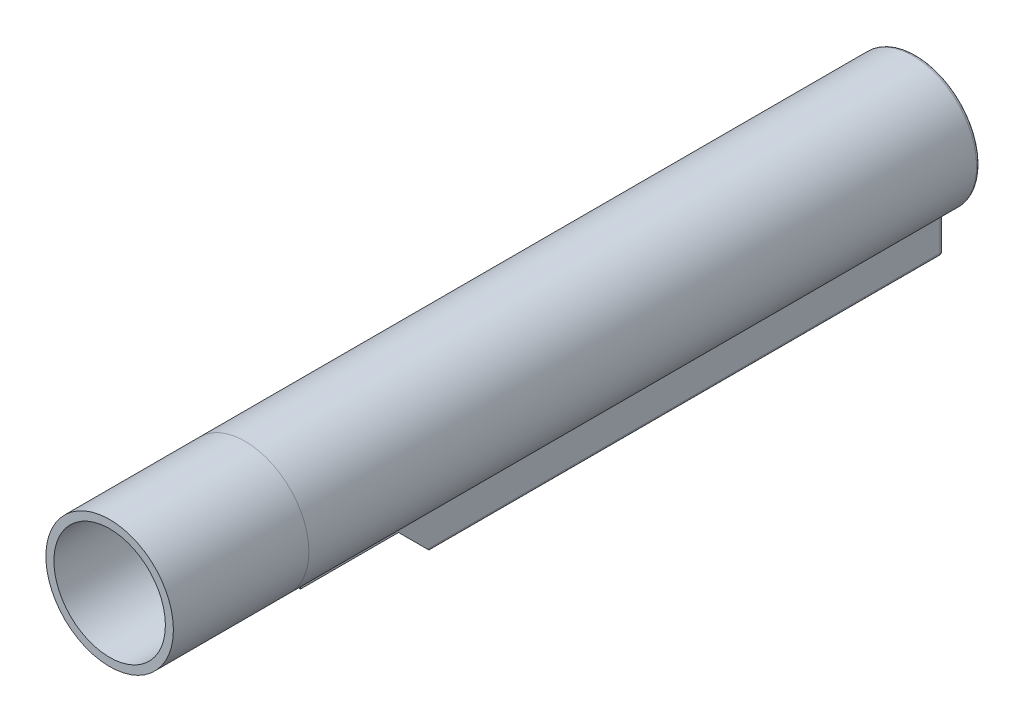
ISO-10303-21;
HEADER;
FILE_DESCRIPTION(('STEP AP214'),'2;1');
FILE_NAME('part.step','',(''),(''),'','','');
FILE_SCHEMA(('AUTOMOTIVE_DESIGN { 1 0 10303 214 1 1 1 1 }'));
ENDSEC;
DATA;
#1=APPLICATION_CONTEXT('core data for automotive mechanical design processes');
#2=APPLICATION_PROTOCOL_DEFINITION('international standard','automotive_design',2000,#1);
#3=PRODUCT_CONTEXT('',#1,'mechanical');
#4=PRODUCT('Part','Part','',(#3));
#5=PRODUCT_RELATED_PRODUCT_CATEGORY('part','',(#4));
#6=PRODUCT_DEFINITION_FORMATION('','',#4);
#7=PRODUCT_DEFINITION_CONTEXT('part definition',#1,'design');
#8=PRODUCT_DEFINITION('design','',#6,#7);
#9=PRODUCT_DEFINITION_SHAPE('','',#8);
#10=(LENGTH_UNIT() NAMED_UNIT(*) SI_UNIT(.MILLI.,.METRE.));
#11=(NAMED_UNIT(*) PLANE_ANGLE_UNIT() SI_UNIT($,.RADIAN.));
#12=(NAMED_UNIT(*) SI_UNIT($,.STERADIAN.) SOLID_ANGLE_UNIT());
#13=UNCERTAINTY_MEASURE_WITH_UNIT(LENGTH_MEASURE(1.E-05),#10,'distance_accuracy_value','');
#14=(GEOMETRIC_REPRESENTATION_CONTEXT(3) GLOBAL_UNCERTAINTY_ASSIGNED_CONTEXT((#13)) GLOBAL_UNIT_ASSIGNED_CONTEXT((#10,
#11,#12)) REPRESENTATION_CONTEXT('',''));
#15=CARTESIAN_POINT('',(0.,0.,0.));
#16=DIRECTION('',(0.,0.,1.));
#17=DIRECTION('',(1.,0.,0.));
#18=AXIS2_PLACEMENT_3D('',#15,#16,#17);
#19=CARTESIAN_POINT('',(0.,0.,146.5326));
#20=DIRECTION('',(0.,0.,-1.));
#21=DIRECTION('',(-1.,0.,0.));
#22=AXIS2_PLACEMENT_3D('',#19,#20,#21);
#23=CYLINDRICAL_SURFACE('',#22,14.5288);
#24=CARTESIAN_POINT('',(0.,0.,146.5326));
#25=DIRECTION('',(0.,0.,1.));
#26=DIRECTION('',(1.,0.,0.));
#27=AXIS2_PLACEMENT_3D('',#24,#25,#26);
#28=CIRCLE('',#27,14.5288);
#29=CARTESIAN_POINT('',(-6.66204510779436,-12.9113587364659,146.5326));
#30=VERTEX_POINT('',#29);
#31=CARTESIAN_POINT('',(6.66204510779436,-12.9113587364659,146.5326));
#32=VERTEX_POINT('',#31);
#33=EDGE_CURVE('E54',#30,#32,#28,.T.);
#34=ORIENTED_EDGE('',*,*,#33,.T.);
#35=DIRECTION('',(0.,0.,-1.));
#36=VECTOR('',#35,1.);
#37=CARTESIAN_POINT('',(6.66204510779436,-12.9113587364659,146.5326));
#38=LINE('',#37,#36);
#39=CARTESIAN_POINT('',(6.66204510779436,-12.9113587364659,0.787399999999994));
#40=VERTEX_POINT('',#39);
#41=EDGE_CURVE('E59',#32,#40,#38,.T.);
#42=ORIENTED_EDGE('',*,*,#41,.T.);
#43=CARTESIAN_POINT('',(0.,0.,0.787399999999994));
#44=DIRECTION('',(0.,0.,1.));
#45=DIRECTION('',(1.,0.,0.));
#46=AXIS2_PLACEMENT_3D('',#43,#44,#45);
#47=CIRCLE('',#46,14.5288);
#48=CARTESIAN_POINT('',(-6.66204510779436,-12.9113587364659,0.787399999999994));
#49=VERTEX_POINT('',#48);
#50=EDGE_CURVE('E328',#40,#49,#47,.T.);
#51=ORIENTED_EDGE('',*,*,#50,.T.);
#52=DIRECTION('',(0.,0.,-1.));
#53=VECTOR('',#52,1.);
#54=CARTESIAN_POINT('',(-6.66204510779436,-12.9113587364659,146.5326));
#55=LINE('',#54,#53);
#56=EDGE_CURVE('E326',#49,#30,#55,.F.);
#57=ORIENTED_EDGE('',*,*,#56,.T.);
#58=EDGE_LOOP('',(#34,#42,#51,#57));
#59=FACE_BOUND('',#58,.T.);
#60=CARTESIAN_POINT('',(0.,0.,152.9334));
#61=DIRECTION('',(0.,0.,1.));
#62=DIRECTION('',(1.,0.,0.));
#63=AXIS2_PLACEMENT_3D('',#60,#61,#62);
#64=CIRCLE('',#63,14.5288);
#65=CARTESIAN_POINT('',(14.5288,0.,152.9334));
#66=VERTEX_POINT('',#65);
#67=EDGE_CURVE('E12',#66,#66,#64,.T.);
#68=ORIENTED_EDGE('',*,*,#67,.F.);
#69=EDGE_LOOP('',(#68));
#70=FACE_BOUND('',#69,.T.);
#71=ADVANCED_FACE('F38',(#59,#70),#23,.T.);
#72=CARTESIAN_POINT('',(0.,-18.288,97.1677));
#73=DIRECTION('',(0.,-1.,0.));
#74=DIRECTION('',(0.,0.,-1.));
#75=AXIS2_PLACEMENT_3D('',#72,#73,#74);
#76=PLANE('',#75);
#77=CARTESIAN_POINT('',(0.,-18.288,36.1823));
#78=DIRECTION('',(0.,-1.,0.));
#79=DIRECTION('',(0.,0.,-1.));
#80=AXIS2_PLACEMENT_3D('',#77,#78,#79);
#81=CIRCLE('',#80,4.22910000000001);
#82=CARTESIAN_POINT('',(4.22910000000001,-18.288,36.1823));
#83=VERTEX_POINT('',#82);
#84=CARTESIAN_POINT('',(-4.22909999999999,-18.288,36.1823));
#85=VERTEX_POINT('',#84);
#86=EDGE_CURVE('E214',#83,#85,#81,.T.);
#87=ORIENTED_EDGE('',*,*,#86,.F.);
#88=DIRECTION('',(0.,0.,1.));
#89=VECTOR('',#88,1.);
#90=CARTESIAN_POINT('',(4.2291,-18.288,97.1677));
#91=LINE('',#90,#89);
#92=CARTESIAN_POINT('',(4.2291,-18.288,57.2643));
#93=VERTEX_POINT('',#92);
#94=EDGE_CURVE('E206',#83,#93,#91,.T.);
#95=ORIENTED_EDGE('',*,*,#94,.T.);
#96=CARTESIAN_POINT('',(0.,-18.288,57.2643));
#97=DIRECTION('',(0.,-1.,0.));
#98=DIRECTION('',(0.,0.,-1.));
#99=AXIS2_PLACEMENT_3D('',#96,#97,#98);
#100=CIRCLE('',#99,4.2291);
#101=CARTESIAN_POINT('',(-4.2291,-18.288,57.2643));
#102=VERTEX_POINT('',#101);
#103=EDGE_CURVE('E180',#102,#93,#100,.T.);
#104=ORIENTED_EDGE('',*,*,#103,.F.);
#105=DIRECTION('',(0.,0.,-1.));
#106=VECTOR('',#105,1.);
#107=CARTESIAN_POINT('',(-4.2291,-18.288,97.1677));
#108=LINE('',#107,#106);
#109=EDGE_CURVE('E412',#102,#85,#108,.T.);
#110=ORIENTED_EDGE('',*,*,#109,.T.);
#111=EDGE_LOOP('',(#87,#95,#104,#110));
#112=FACE_BOUND('',#111,.T.);
#113=ADVANCED_FACE('F213',(#112),#76,.T.);
#114=EDGE_CURVE('E184',#93,#102,#100,.T.);
#115=ORIENTED_EDGE('',*,*,#114,.F.);
#116=CARTESIAN_POINT('',(4.2291,-18.288,97.1677));
#117=VERTEX_POINT('',#116);
#118=EDGE_CURVE('E195',#93,#117,#91,.T.);
#119=ORIENTED_EDGE('',*,*,#118,.T.);
#120=CARTESIAN_POINT('',(0.,-18.288,97.1677));
#121=DIRECTION('',(0.,-1.,0.));
#122=DIRECTION('',(0.,0.,-1.));
#123=AXIS2_PLACEMENT_3D('',#120,#121,#122);
#124=CIRCLE('',#123,4.2291);
#125=CARTESIAN_POINT('',(-4.2291,-18.288,97.1677));
#126=VERTEX_POINT('',#125);
#127=EDGE_CURVE('E189',#126,#117,#124,.T.);
#128=ORIENTED_EDGE('',*,*,#127,.F.);
#129=EDGE_CURVE('E198',#126,#102,#108,.T.);
#130=ORIENTED_EDGE('',*,*,#129,.T.);
#131=EDGE_LOOP('',(#115,#119,#128,#130));
#132=FACE_BOUND('',#131,.T.);
#133=ADVANCED_FACE('F194',(#132),#76,.T.);
#134=CARTESIAN_POINT('',(-6.2357,-22.098,146.5326));
#135=DIRECTION('',(0.,1.,0.));
#136=DIRECTION('',(0.,0.,1.));
#137=AXIS2_PLACEMENT_3D('',#134,#135,#136);
#138=PLANE('',#137);
#139=DIRECTION('',(-1.,0.,0.));
#140=VECTOR('',#139,1.);
#141=CARTESIAN_POINT('',(-6.2357,-22.098,116.84));
#142=LINE('',#141,#140);
#143=CARTESIAN_POINT('',(5.4483,-22.098,116.84));
#144=VERTEX_POINT('',#143);
#145=CARTESIAN_POINT('',(-5.4483,-22.098,116.84));
#146=VERTEX_POINT('',#145);
#147=EDGE_CURVE('E263',#144,#146,#142,.T.);
#148=ORIENTED_EDGE('',*,*,#147,.T.);
#149=DIRECTION('',(0.,0.,-1.));
#150=VECTOR('',#149,1.);
#151=CARTESIAN_POINT('',(-5.4483,-22.098,146.5326));
#152=LINE('',#151,#150);
#153=CARTESIAN_POINT('',(-5.4483,-22.098,0.787399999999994));
#154=VERTEX_POINT('',#153);
#155=EDGE_CURVE('E316',#146,#154,#152,.T.);
#156=ORIENTED_EDGE('',*,*,#155,.T.);
#157=DIRECTION('',(1.,0.,0.));
#158=VECTOR('',#157,1.);
#159=CARTESIAN_POINT('',(-6.2357,-22.098,0.787399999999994));
#160=LINE('',#159,#158);
#161=CARTESIAN_POINT('',(5.4483,-22.098,0.787399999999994));
#162=VERTEX_POINT('',#161);
#163=EDGE_CURVE('E312',#154,#162,#160,.T.);
#164=ORIENTED_EDGE('',*,*,#163,.T.);
#165=DIRECTION('',(0.,0.,-1.));
#166=VECTOR('',#165,1.);
#167=CARTESIAN_POINT('',(5.4483,-22.098,146.5326));
#168=LINE('',#167,#166);
#169=EDGE_CURVE('E314',#162,#144,#168,.F.);
#170=ORIENTED_EDGE('',*,*,#169,.T.);
#171=EDGE_LOOP('',(#148,#156,#164,#170));
#172=FACE_BOUND('',#171,.T.);
#173=DIRECTION('',(0.,0.,1.));
#174=VECTOR('',#173,1.);
#175=CARTESIAN_POINT('',(5.01649999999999,-22.098,146.5326));
#176=LINE('',#175,#174);
#177=CARTESIAN_POINT('',(5.0165,-22.098,97.1677));
#178=VERTEX_POINT('',#177);
#179=CARTESIAN_POINT('',(5.01650000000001,-22.098,15.1003));
#180=VERTEX_POINT('',#179);
#181=EDGE_CURVE('E303',#178,#180,#176,.F.);
#182=ORIENTED_EDGE('',*,*,#181,.T.);
#183=CARTESIAN_POINT('',(0.,-22.098,15.1003));
#184=DIRECTION('',(0.,1.,0.));
#185=DIRECTION('',(0.,0.,1.));
#186=AXIS2_PLACEMENT_3D('',#183,#184,#185);
#187=CIRCLE('',#186,5.0165);
#188=CARTESIAN_POINT('',(-5.01649999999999,-22.098,15.1003));
#189=VERTEX_POINT('',#188);
#190=EDGE_CURVE('E309',#180,#189,#187,.T.);
#191=ORIENTED_EDGE('',*,*,#190,.T.);
#192=DIRECTION('',(0.,0.,-1.));
#193=VECTOR('',#192,1.);
#194=CARTESIAN_POINT('',(-5.01650000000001,-22.098,146.5326));
#195=LINE('',#194,#193);
#196=CARTESIAN_POINT('',(-5.0165,-22.098,97.1677));
#197=VERTEX_POINT('',#196);
#198=EDGE_CURVE('E307',#189,#197,#195,.F.);
#199=ORIENTED_EDGE('',*,*,#198,.T.);
#200=CARTESIAN_POINT('',(0.,-22.098,97.1677));
#201=DIRECTION('',(0.,1.,0.));
#202=DIRECTION('',(0.,0.,1.));
#203=AXIS2_PLACEMENT_3D('',#200,#201,#202);
#204=CIRCLE('',#203,5.0165);
#205=EDGE_CURVE('E305',#197,#178,#204,.T.);
#206=ORIENTED_EDGE('',*,*,#205,.T.);
#207=EDGE_LOOP('',(#182,#191,#199,#206));
#208=FACE_BOUND('',#207,.T.);
#209=ADVANCED_FACE('F391',(#172,#208),#138,.F.);
#210=CARTESIAN_POINT('',(0.,0.,146.5326));
#211=DIRECTION('',(0.,0.,-1.));
#212=DIRECTION('',(-1.,0.,0.));
#213=AXIS2_PLACEMENT_3D('',#210,#211,#212);
#214=CYLINDRICAL_SURFACE('',#213,1.1938);
#215=CARTESIAN_POINT('',(0.,0.,0.));
#216=DIRECTION('',(0.,0.,1.));
#217=DIRECTION('',(1.,0.,0.));
#218=AXIS2_PLACEMENT_3D('',#215,#216,#217);
#219=CIRCLE('',#218,1.1938);
#220=CARTESIAN_POINT('',(1.1938,0.,0.));
#221=VERTEX_POINT('',#220);
#222=EDGE_CURVE('E246',#221,#221,#219,.T.);
#223=ORIENTED_EDGE('',*,*,#222,.F.);
#224=EDGE_LOOP('',(#223));
#225=FACE_BOUND('',#224,.T.);
#226=CARTESIAN_POINT('',(0.,0.,1.82879999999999));
#227=DIRECTION('',(0.,0.,1.));
#228=DIRECTION('',(1.,0.,0.));
#229=AXIS2_PLACEMENT_3D('',#226,#227,#228);
#230=CIRCLE('',#229,1.1938);
#231=CARTESIAN_POINT('',(1.1938,0.,1.82879999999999));
#232=VERTEX_POINT('',#231);
#233=EDGE_CURVE('E242',#232,#232,#230,.T.);
#234=ORIENTED_EDGE('',*,*,#233,.T.);
#235=EDGE_LOOP('',(#234));
#236=FACE_BOUND('',#235,.T.);
#237=ADVANCED_FACE('F485',(#225,#236),#214,.F.);
#238=CARTESIAN_POINT('',(0.,0.,146.5326));
#239=DIRECTION('',(0.,0.,1.));
#240=DIRECTION('',(1.,0.,0.));
#241=AXIS2_PLACEMENT_3D('',#238,#239,#240);
#242=PLANE('',#241);
#243=DIRECTION('',(-1.,0.,0.));
#244=VECTOR('',#243,1.);
#245=CARTESIAN_POINT('',(10.6395598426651,-14.732,146.5326));
#246=LINE('',#245,#244);
#247=CARTESIAN_POINT('',(6.2357,-14.732,146.5326));
#248=VERTEX_POINT('',#247);
#249=CARTESIAN_POINT('',(-6.2357,-14.732,146.5326));
#250=VERTEX_POINT('',#249);
#251=EDGE_CURVE('E220',#248,#250,#246,.T.);
#252=ORIENTED_EDGE('',*,*,#251,.F.);
#253=DIRECTION('',(0.,1.,0.));
#254=VECTOR('',#253,1.);
#255=CARTESIAN_POINT('',(6.2357,-13.1225788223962,146.5326));
#256=LINE('',#255,#254);
#257=CARTESIAN_POINT('',(6.2357,-13.6111002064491,146.5326));
#258=VERTEX_POINT('',#257);
#259=EDGE_CURVE('E252',#248,#258,#256,.T.);
#260=ORIENTED_EDGE('',*,*,#259,.T.);
#261=CARTESIAN_POINT('',(7.0231,-13.6111002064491,146.5326));
#262=DIRECTION('',(0.,0.,1.));
#263=DIRECTION('',(1.,0.,0.));
#264=AXIS2_PLACEMENT_3D('',#261,#262,#263);
#265=CIRCLE('',#264,0.7874);
#266=EDGE_CURVE('E333',#258,#32,#265,.F.);
#267=ORIENTED_EDGE('',*,*,#266,.T.);
#268=ORIENTED_EDGE('',*,*,#33,.F.);
#269=CARTESIAN_POINT('',(-7.0231,-13.6111002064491,146.5326));
#270=DIRECTION('',(0.,0.,1.));
#271=DIRECTION('',(1.,0.,0.));
#272=AXIS2_PLACEMENT_3D('',#269,#270,#271);
#273=CIRCLE('',#272,0.7874);
#274=CARTESIAN_POINT('',(-6.2357,-13.6111002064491,146.5326));
#275=VERTEX_POINT('',#274);
#276=EDGE_CURVE('E47',#30,#275,#273,.F.);
#277=ORIENTED_EDGE('',*,*,#276,.T.);
#278=DIRECTION('',(0.,-1.,0.));
#279=VECTOR('',#278,1.);
#280=CARTESIAN_POINT('',(-6.2357,-13.1225788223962,146.5326));
#281=LINE('',#280,#279);
#282=EDGE_CURVE('E250',#275,#250,#281,.T.);
#283=ORIENTED_EDGE('',*,*,#282,.T.);
#284=EDGE_LOOP('',(#252,#260,#267,#268,#277,#283));
#285=FACE_BOUND('',#284,.T.);
#286=ADVANCED_FACE('F707',(#285),#242,.T.);
#287=CARTESIAN_POINT('',(0.,0.,0.));
#288=DIRECTION('',(0.,0.,1.));
#289=DIRECTION('',(1.,0.,0.));
#290=AXIS2_PLACEMENT_3D('',#287,#288,#289);
#291=PLANE('',#290);
#292=DIRECTION('',(0.,1.,0.));
#293=VECTOR('',#292,1.);
#294=CARTESIAN_POINT('',(5.4483,0.,0.));
#295=LINE('',#294,#293);
#296=CARTESIAN_POINT('',(5.4483,-13.6111002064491,0.));
#297=VERTEX_POINT('',#296);
#298=CARTESIAN_POINT('',(5.4483,-21.3106,0.));
#299=VERTEX_POINT('',#298);
#300=EDGE_CURVE('E289',#297,#299,#295,.F.);
#301=ORIENTED_EDGE('',*,*,#300,.T.);
#302=DIRECTION('',(1.,0.,0.));
#303=VECTOR('',#302,1.);
#304=CARTESIAN_POINT('',(0.,-21.3106,0.));
#305=LINE('',#304,#303);
#306=CARTESIAN_POINT('',(-5.4483,-21.3106,0.));
#307=VERTEX_POINT('',#306);
#308=EDGE_CURVE('E292',#299,#307,#305,.F.);
#309=ORIENTED_EDGE('',*,*,#308,.T.);
#310=DIRECTION('',(0.,-1.,0.));
#311=VECTOR('',#310,1.);
#312=CARTESIAN_POINT('',(-5.4483,0.,0.));
#313=LINE('',#312,#311);
#314=CARTESIAN_POINT('',(-5.4483,-13.6111002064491,0.));
#315=VERTEX_POINT('',#314);
#316=EDGE_CURVE('E287',#307,#315,#313,.F.);
#317=ORIENTED_EDGE('',*,*,#316,.T.);
#318=CARTESIAN_POINT('',(-7.0231,-13.6111002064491,0.));
#319=DIRECTION('',(0.,0.,1.));
#320=DIRECTION('',(1.,0.,0.));
#321=AXIS2_PLACEMENT_3D('',#318,#319,#320);
#322=CIRCLE('',#321,1.5748);
#323=CARTESIAN_POINT('',(-6.30099021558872,-12.2116172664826,0.));
#324=VERTEX_POINT('',#323);
#325=EDGE_CURVE('E284',#324,#315,#322,.F.);
#326=ORIENTED_EDGE('',*,*,#325,.F.);
#327=CARTESIAN_POINT('',(0.,0.,0.));
#328=DIRECTION('',(0.,0.,1.));
#329=DIRECTION('',(1.,0.,0.));
#330=AXIS2_PLACEMENT_3D('',#327,#328,#329);
#331=CIRCLE('',#330,13.7414);
#332=CARTESIAN_POINT('',(6.30099021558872,-12.2116172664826,0.));
#333=VERTEX_POINT('',#332);
#334=EDGE_CURVE('E282',#324,#333,#331,.F.);
#335=ORIENTED_EDGE('',*,*,#334,.T.);
#336=CARTESIAN_POINT('',(7.0231,-13.6111002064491,0.));
#337=DIRECTION('',(0.,0.,1.));
#338=DIRECTION('',(1.,0.,0.));
#339=AXIS2_PLACEMENT_3D('',#336,#337,#338);
#340=CIRCLE('',#339,1.5748);
#341=EDGE_CURVE('E279',#297,#333,#340,.F.);
#342=ORIENTED_EDGE('',*,*,#341,.F.);
#343=EDGE_LOOP('',(#301,#309,#317,#326,#335,#342));
#344=FACE_BOUND('',#343,.T.);
#345=ORIENTED_EDGE('',*,*,#222,.T.);
#346=EDGE_LOOP('',(#345));
#347=FACE_BOUND('',#346,.T.);
#348=ADVANCED_FACE('F480',(#344,#347),#291,.F.);
#349=CARTESIAN_POINT('',(-6.2357,-13.1225788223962,146.5326));
#350=DIRECTION('',(1.,0.,0.));
#351=DIRECTION('',(0.,0.,-1.));
#352=AXIS2_PLACEMENT_3D('',#349,#350,#351);
#353=PLANE('',#352);
#354=DIRECTION('',(0.,-1.,0.));
#355=VECTOR('',#354,1.);
#356=CARTESIAN_POINT('',(-6.2357,-13.1225788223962,0.787399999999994));
#357=LINE('',#356,#355);
#358=CARTESIAN_POINT('',(-6.2357,-13.6111002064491,0.787399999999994));
#359=VERTEX_POINT('',#358);
#360=CARTESIAN_POINT('',(-6.2357,-21.3106,0.787399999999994));
#361=VERTEX_POINT('',#360);
#362=EDGE_CURVE('E296',#359,#361,#357,.T.);
#363=ORIENTED_EDGE('',*,*,#362,.T.);
#364=DIRECTION('',(0.,0.,-1.));
#365=VECTOR('',#364,1.);
#366=CARTESIAN_POINT('',(-6.2357,-21.3106,146.5326));
#367=LINE('',#366,#365);
#368=CARTESIAN_POINT('',(-6.2357,-21.3106,117.6274));
#369=VERTEX_POINT('',#368);
#370=EDGE_CURVE('E298',#361,#369,#367,.F.);
#371=ORIENTED_EDGE('',*,*,#370,.T.);
#372=DIRECTION('',(0.,0.707106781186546,0.707106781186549));
#373=VECTOR('',#372,1.);
#374=CARTESIAN_POINT('',(-6.2357,-14.732,124.206));
#375=LINE('',#374,#373);
#376=CARTESIAN_POINT('',(-6.2357,-14.732,124.206));
#377=VERTEX_POINT('',#376);
#378=EDGE_CURVE('E266',#369,#377,#375,.T.);
#379=ORIENTED_EDGE('',*,*,#378,.T.);
#380=DIRECTION('',(0.,0.,1.));
#381=VECTOR('',#380,1.);
#382=CARTESIAN_POINT('',(-6.2357,-14.732,146.5326));
#383=LINE('',#382,#381);
#384=EDGE_CURVE('E231',#377,#250,#383,.T.);
#385=ORIENTED_EDGE('',*,*,#384,.T.);
#386=ORIENTED_EDGE('',*,*,#282,.F.);
#387=DIRECTION('',(0.,0.,1.));
#388=VECTOR('',#387,1.);
#389=CARTESIAN_POINT('',(-6.2357,-13.6111002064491,0.));
#390=LINE('',#389,#388);
#391=EDGE_CURVE('E294',#275,#359,#390,.F.);
#392=ORIENTED_EDGE('',*,*,#391,.T.);
#393=EDGE_LOOP('',(#363,#371,#379,#385,#386,#392));
#394=FACE_BOUND('',#393,.T.);
#395=ADVANCED_FACE('F471',(#394),#353,.F.);
#396=CARTESIAN_POINT('',(6.2357,-13.1225788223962,146.5326));
#397=DIRECTION('',(-1.,0.,0.));
#398=DIRECTION('',(0.,0.,1.));
#399=AXIS2_PLACEMENT_3D('',#396,#397,#398);
#400=PLANE('',#399);
#401=DIRECTION('',(0.,-0.707106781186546,-0.707106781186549));
#402=VECTOR('',#401,1.);
#403=CARTESIAN_POINT('',(6.2357,-14.732,124.206));
#404=LINE('',#403,#402);
#405=CARTESIAN_POINT('',(6.2357,-14.732,124.206));
#406=VERTEX_POINT('',#405);
#407=CARTESIAN_POINT('',(6.2357,-21.3106,117.6274));
#408=VERTEX_POINT('',#407);
#409=EDGE_CURVE('E260',#406,#408,#404,.T.);
#410=ORIENTED_EDGE('',*,*,#409,.T.);
#411=DIRECTION('',(0.,0.,-1.));
#412=VECTOR('',#411,1.);
#413=CARTESIAN_POINT('',(6.2357,-21.3106,146.5326));
#414=LINE('',#413,#412);
#415=CARTESIAN_POINT('',(6.2357,-21.3106,0.787399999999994));
#416=VERTEX_POINT('',#415);
#417=EDGE_CURVE('E277',#408,#416,#414,.T.);
#418=ORIENTED_EDGE('',*,*,#417,.T.);
#419=DIRECTION('',(0.,1.,0.));
#420=VECTOR('',#419,1.);
#421=CARTESIAN_POINT('',(6.2357,-13.1225788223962,0.787399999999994));
#422=LINE('',#421,#420);
#423=CARTESIAN_POINT('',(6.2357,-13.6111002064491,0.787399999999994));
#424=VERTEX_POINT('',#423);
#425=EDGE_CURVE('E274',#416,#424,#422,.T.);
#426=ORIENTED_EDGE('',*,*,#425,.T.);
#427=DIRECTION('',(0.,0.,1.));
#428=VECTOR('',#427,1.);
#429=CARTESIAN_POINT('',(6.2357,-13.6111002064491,146.5326));
#430=LINE('',#429,#428);
#431=EDGE_CURVE('E272',#424,#258,#430,.T.);
#432=ORIENTED_EDGE('',*,*,#431,.T.);
#433=ORIENTED_EDGE('',*,*,#259,.F.);
#434=DIRECTION('',(0.,0.,-1.));
#435=VECTOR('',#434,1.);
#436=CARTESIAN_POINT('',(6.2357,-14.732,146.5326));
#437=LINE('',#436,#435);
#438=EDGE_CURVE('E255',#248,#406,#437,.T.);
#439=ORIENTED_EDGE('',*,*,#438,.T.);
#440=EDGE_LOOP('',(#410,#418,#426,#432,#433,#439));
#441=FACE_BOUND('',#440,.T.);
#442=ADVANCED_FACE('F462',(#441),#400,.F.);
#443=ORIENTED_EDGE('',*,*,#67,.T.);
#444=EDGE_LOOP('',(#443));
#445=FACE_BOUND('',#444,.T.);
#446=CARTESIAN_POINT('',(0.,0.,183.7944));
#447=DIRECTION('',(0.,0.,1.));
#448=DIRECTION('',(1.,0.,0.));
#449=AXIS2_PLACEMENT_3D('',#446,#447,#448);
#450=CIRCLE('',#449,14.5288);
#451=CARTESIAN_POINT('',(14.5288,0.,183.7944));
#452=VERTEX_POINT('',#451);
#453=EDGE_CURVE('E243',#452,#452,#450,.T.);
#454=ORIENTED_EDGE('',*,*,#453,.F.);
#455=EDGE_LOOP('',(#454));
#456=FACE_BOUND('',#455,.T.);
#457=ADVANCED_FACE('F452',(#445,#456),#23,.T.);
#458=CARTESIAN_POINT('',(0.,0.,183.7944));
#459=DIRECTION('',(0.,0.,1.));
#460=DIRECTION('',(1.,0.,0.));
#461=AXIS2_PLACEMENT_3D('',#458,#459,#460);
#462=PLANE('',#461);
#463=CARTESIAN_POINT('',(0.,0.,183.7944));
#464=DIRECTION('',(0.,0.,1.));
#465=DIRECTION('',(1.,0.,0.));
#466=AXIS2_PLACEMENT_3D('',#463,#464,#465);
#467=CIRCLE('',#466,12.7);
#468=CARTESIAN_POINT('',(12.7,0.,183.7944));
#469=VERTEX_POINT('',#468);
#470=EDGE_CURVE('E236',#469,#469,#467,.T.);
#471=ORIENTED_EDGE('',*,*,#470,.F.);
#472=EDGE_LOOP('',(#471));
#473=FACE_BOUND('',#472,.T.);
#474=ORIENTED_EDGE('',*,*,#453,.T.);
#475=EDGE_LOOP('',(#474));
#476=FACE_BOUND('',#475,.T.);
#477=ADVANCED_FACE('F461',(#473,#476),#462,.T.);
#478=CARTESIAN_POINT('',(0.,0.,-35.9210244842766));
#479=DIRECTION('',(0.,0.,1.));
#480=DIRECTION('',(1.,0.,0.));
#481=AXIS2_PLACEMENT_3D('',#478,#479,#480);
#482=CYLINDRICAL_SURFACE('',#481,12.7);
#483=CARTESIAN_POINT('',(0.,0.,1.8288));
#484=DIRECTION('',(0.,0.,1.));
#485=DIRECTION('',(1.,0.,0.));
#486=AXIS2_PLACEMENT_3D('',#483,#484,#485);
#487=CIRCLE('',#486,12.7);
#488=CARTESIAN_POINT('',(12.7,0.,1.8288));
#489=VERTEX_POINT('',#488);
#490=EDGE_CURVE('E239',#489,#489,#487,.F.);
#491=ORIENTED_EDGE('',*,*,#490,.T.);
#492=EDGE_LOOP('',(#491));
#493=FACE_BOUND('',#492,.T.);
#494=ORIENTED_EDGE('',*,*,#470,.T.);
#495=EDGE_LOOP('',(#494));
#496=FACE_BOUND('',#495,.T.);
#497=ADVANCED_FACE('F468',(#493,#496),#482,.F.);
#498=CARTESIAN_POINT('',(0.,0.,1.8288));
#499=DIRECTION('',(0.,0.,1.));
#500=DIRECTION('',(1.,0.,0.));
#501=AXIS2_PLACEMENT_3D('',#498,#499,#500);
#502=PLANE('',#501);
#503=ORIENTED_EDGE('',*,*,#233,.F.);
#504=EDGE_LOOP('',(#503));
#505=FACE_BOUND('',#504,.T.);
#506=ORIENTED_EDGE('',*,*,#490,.F.);
#507=EDGE_LOOP('',(#506));
#508=FACE_BOUND('',#507,.T.);
#509=ADVANCED_FACE('F670',(#505,#508),#502,.T.);
#510=CARTESIAN_POINT('',(10.6395598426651,-14.732,124.206));
#511=DIRECTION('',(0.,1.,0.));
#512=DIRECTION('',(-1.,0.,0.));
#513=AXIS2_PLACEMENT_3D('',#510,#511,#512);
#514=PLANE('',#513);
#515=DIRECTION('',(-1.,0.,0.));
#516=VECTOR('',#515,1.);
#517=CARTESIAN_POINT('',(10.6395598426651,-14.732,124.206));
#518=LINE('',#517,#516);
#519=EDGE_CURVE('E228',#406,#377,#518,.T.);
#520=ORIENTED_EDGE('',*,*,#519,.F.);
#521=ORIENTED_EDGE('',*,*,#438,.F.);
#522=ORIENTED_EDGE('',*,*,#251,.T.);
#523=ORIENTED_EDGE('',*,*,#384,.F.);
#524=EDGE_LOOP('',(#520,#521,#522,#523));
#525=FACE_BOUND('',#524,.T.);
#526=ADVANCED_FACE('F490',(#525),#514,.F.);
#527=CARTESIAN_POINT('',(0.,-14.732,124.206));
#528=DIRECTION('',(0.,-0.707106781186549,0.707106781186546));
#529=DIRECTION('',(-1.,0.,0.));
#530=AXIS2_PLACEMENT_3D('',#527,#528,#529);
#531=PLANE('',#530);
#532=ORIENTED_EDGE('',*,*,#378,.F.);
#533=CARTESIAN_POINT('',(-5.4483,-21.3106,117.6274));
#534=DIRECTION('',(0.,-0.707106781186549,0.707106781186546));
#535=DIRECTION('',(0.,-0.707106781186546,-0.707106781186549));
#536=AXIS2_PLACEMENT_3D('',#533,#534,#535);
#537=ELLIPSE('',#536,1.11355175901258,0.7874);
#538=EDGE_CURVE('E324',#369,#146,#537,.T.);
#539=ORIENTED_EDGE('',*,*,#538,.T.);
#540=ORIENTED_EDGE('',*,*,#147,.F.);
#541=CARTESIAN_POINT('',(5.4483,-21.3106,117.6274));
#542=DIRECTION('',(0.,-0.707106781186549,0.707106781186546));
#543=DIRECTION('',(0.,-0.707106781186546,-0.707106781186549));
#544=AXIS2_PLACEMENT_3D('',#541,#542,#543);
#545=ELLIPSE('',#544,1.11355175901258,0.7874);
#546=EDGE_CURVE('E322',#144,#408,#545,.T.);
#547=ORIENTED_EDGE('',*,*,#546,.T.);
#548=ORIENTED_EDGE('',*,*,#409,.F.);
#549=ORIENTED_EDGE('',*,*,#519,.T.);
#550=EDGE_LOOP('',(#532,#539,#540,#547,#548,#549));
#551=FACE_BOUND('',#550,.T.);
#552=ADVANCED_FACE('F420',(#551),#531,.T.);
#553=CARTESIAN_POINT('',(0.,-18.288,97.1677));
#554=DIRECTION('',(0.,-1.,0.));
#555=DIRECTION('',(0.,0.,-1.));
#556=AXIS2_PLACEMENT_3D('',#553,#554,#555);
#557=CYLINDRICAL_SURFACE('',#556,4.2291);
#558=DIRECTION('',(0.,-1.,0.));
#559=VECTOR('',#558,1.);
#560=CARTESIAN_POINT('',(4.2291,-18.288,97.1677));
#561=LINE('',#560,#559);
#562=CARTESIAN_POINT('',(4.2291,-21.3106,97.1677));
#563=VERTEX_POINT('',#562);
#564=EDGE_CURVE('E209',#117,#563,#561,.T.);
#565=ORIENTED_EDGE('',*,*,#564,.T.);
#566=CARTESIAN_POINT('',(0.,-21.3106,97.1677));
#567=DIRECTION('',(0.,1.,0.));
#568=DIRECTION('',(0.,0.,1.));
#569=AXIS2_PLACEMENT_3D('',#566,#567,#568);
#570=CIRCLE('',#569,4.2291);
#571=CARTESIAN_POINT('',(-4.2291,-21.3106,97.1677));
#572=VERTEX_POINT('',#571);
#573=EDGE_CURVE('E320',#563,#572,#570,.F.);
#574=ORIENTED_EDGE('',*,*,#573,.T.);
#575=DIRECTION('',(0.,-1.,0.));
#576=VECTOR('',#575,1.);
#577=CARTESIAN_POINT('',(-4.2291,-18.288,97.1677));
#578=LINE('',#577,#576);
#579=EDGE_CURVE('E215',#126,#572,#578,.T.);
#580=ORIENTED_EDGE('',*,*,#579,.F.);
#581=ORIENTED_EDGE('',*,*,#127,.T.);
#582=EDGE_LOOP('',(#565,#574,#580,#581));
#583=FACE_BOUND('',#582,.T.);
#584=CARTESIAN_POINT('',(0.,-14.4018,97.1677));
#585=DIRECTION('',(0.,-1.,0.));
#586=DIRECTION('',(0.,0.,-1.));
#587=AXIS2_PLACEMENT_3D('',#584,#585,#586);
#588=CIRCLE('',#587,4.2291);
#589=CARTESIAN_POINT('',(0.,-14.4018,92.9386));
#590=VERTEX_POINT('',#589);
#591=EDGE_CURVE('E413',#590,#590,#588,.T.);
#592=ORIENTED_EDGE('',*,*,#591,.F.);
#593=EDGE_LOOP('',(#592));
#594=FACE_BOUND('',#593,.T.);
#595=ADVANCED_FACE('F417',(#583,#594),#557,.F.);
#596=CARTESIAN_POINT('',(4.2291,-18.288,97.1677));
#597=DIRECTION('',(1.,0.,0.));
#598=DIRECTION('',(0.,0.,-1.));
#599=AXIS2_PLACEMENT_3D('',#596,#597,#598);
#600=PLANE('',#599);
#601=DIRECTION('',(0.,-1.,0.));
#602=VECTOR('',#601,1.);
#603=CARTESIAN_POINT('',(4.22910000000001,-18.288,15.1003));
#604=LINE('',#603,#602);
#605=CARTESIAN_POINT('',(4.22910000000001,-18.288,15.1003));
#606=VERTEX_POINT('',#605);
#607=CARTESIAN_POINT('',(4.22910000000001,-21.3106,15.1003));
#608=VERTEX_POINT('',#607);
#609=EDGE_CURVE('E221',#606,#608,#604,.T.);
#610=ORIENTED_EDGE('',*,*,#609,.T.);
#611=DIRECTION('',(0.,0.,1.));
#612=VECTOR('',#611,1.);
#613=CARTESIAN_POINT('',(4.2291,-21.3106,97.1677));
#614=LINE('',#613,#612);
#615=EDGE_CURVE('E331',#608,#563,#614,.T.);
#616=ORIENTED_EDGE('',*,*,#615,.T.);
#617=ORIENTED_EDGE('',*,*,#564,.F.);
#618=ORIENTED_EDGE('',*,*,#118,.F.);
#619=ORIENTED_EDGE('',*,*,#94,.F.);
#620=EDGE_CURVE('E211',#606,#83,#91,.T.);
#621=ORIENTED_EDGE('',*,*,#620,.F.);
#622=EDGE_LOOP('',(#610,#616,#617,#618,#619,#621));
#623=FACE_BOUND('',#622,.T.);
#624=ADVANCED_FACE('F204',(#623),#600,.F.);
#625=CARTESIAN_POINT('',(0.,-18.288,15.1003));
#626=DIRECTION('',(0.,-1.,0.));
#627=DIRECTION('',(0.,0.,-1.));
#628=AXIS2_PLACEMENT_3D('',#625,#626,#627);
#629=CYLINDRICAL_SURFACE('',#628,4.2291);
#630=DIRECTION('',(0.,-1.,0.));
#631=VECTOR('',#630,1.);
#632=CARTESIAN_POINT('',(-4.22909999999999,-18.288,15.1003));
#633=LINE('',#632,#631);
#634=CARTESIAN_POINT('',(-4.22909999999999,-18.288,15.1003));
#635=VERTEX_POINT('',#634);
#636=CARTESIAN_POINT('',(-4.22909999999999,-21.3106,15.1003));
#637=VERTEX_POINT('',#636);
#638=EDGE_CURVE('E223',#635,#637,#633,.T.);
#639=ORIENTED_EDGE('',*,*,#638,.T.);
#640=CARTESIAN_POINT('',(0.,-21.3106,15.1003));
#641=DIRECTION('',(0.,1.,0.));
#642=DIRECTION('',(0.,0.,1.));
#643=AXIS2_PLACEMENT_3D('',#640,#641,#642);
#644=CIRCLE('',#643,4.2291);
#645=EDGE_CURVE('E300',#637,#608,#644,.F.);
#646=ORIENTED_EDGE('',*,*,#645,.T.);
#647=ORIENTED_EDGE('',*,*,#609,.F.);
#648=CARTESIAN_POINT('',(0.,-18.288,15.1003));
#649=DIRECTION('',(0.,-1.,0.));
#650=DIRECTION('',(0.,0.,-1.));
#651=AXIS2_PLACEMENT_3D('',#648,#649,#650);
#652=CIRCLE('',#651,4.2291);
#653=EDGE_CURVE('E270',#606,#635,#652,.T.);
#654=ORIENTED_EDGE('',*,*,#653,.T.);
#655=EDGE_LOOP('',(#639,#646,#647,#654));
#656=FACE_BOUND('',#655,.T.);
#657=CARTESIAN_POINT('',(0.,-14.4018,15.1003));
#658=DIRECTION('',(0.,-1.,0.));
#659=DIRECTION('',(0.,0.,-1.));
#660=AXIS2_PLACEMENT_3D('',#657,#658,#659);
#661=CIRCLE('',#660,4.2291);
#662=CARTESIAN_POINT('',(0.,-14.4018,10.8712));
#663=VERTEX_POINT('',#662);
#664=EDGE_CURVE('E425',#663,#663,#661,.T.);
#665=ORIENTED_EDGE('',*,*,#664,.F.);
#666=EDGE_LOOP('',(#665));
#667=FACE_BOUND('',#666,.T.);
#668=ADVANCED_FACE('F402',(#656,#667),#629,.F.);
#669=CARTESIAN_POINT('',(-4.2291,-18.288,97.1677));
#670=DIRECTION('',(-1.,0.,0.));
#671=DIRECTION('',(0.,0.,1.));
#672=AXIS2_PLACEMENT_3D('',#669,#670,#671);
#673=PLANE('',#672);
#674=ORIENTED_EDGE('',*,*,#579,.T.);
#675=DIRECTION('',(0.,0.,-1.));
#676=VECTOR('',#675,1.);
#677=CARTESIAN_POINT('',(-4.2291,-21.3106,97.1677));
#678=LINE('',#677,#676);
#679=EDGE_CURVE('E318',#572,#637,#678,.T.);
#680=ORIENTED_EDGE('',*,*,#679,.T.);
#681=ORIENTED_EDGE('',*,*,#638,.F.);
#682=EDGE_CURVE('E410',#85,#635,#108,.T.);
#683=ORIENTED_EDGE('',*,*,#682,.F.);
#684=ORIENTED_EDGE('',*,*,#109,.F.);
#685=ORIENTED_EDGE('',*,*,#129,.F.);
#686=EDGE_LOOP('',(#674,#680,#681,#683,#684,#685));
#687=FACE_BOUND('',#686,.T.);
#688=ADVANCED_FACE('F414',(#687),#673,.F.);
#689=ORIENTED_EDGE('',*,*,#653,.F.);
#690=ORIENTED_EDGE('',*,*,#620,.T.);
#691=EDGE_CURVE('E199',#85,#83,#81,.T.);
#692=ORIENTED_EDGE('',*,*,#691,.F.);
#693=ORIENTED_EDGE('',*,*,#682,.T.);
#694=EDGE_LOOP('',(#689,#690,#692,#693));
#695=FACE_BOUND('',#694,.T.);
#696=ADVANCED_FACE('F407',(#695),#76,.T.);
#697=CARTESIAN_POINT('',(0.,-14.4018,97.1677));
#698=DIRECTION('',(0.,-1.,0.));
#699=DIRECTION('',(0.,0.,-1.));
#700=AXIS2_PLACEMENT_3D('',#697,#698,#699);
#701=PLANE('',#700);
#702=ORIENTED_EDGE('',*,*,#591,.T.);
#703=EDGE_LOOP('',(#702));
#704=FACE_BOUND('',#703,.T.);
#705=ADVANCED_FACE('F629',(#704),#701,.T.);
#706=CARTESIAN_POINT('',(0.,-14.4018,57.2643));
#707=DIRECTION('',(0.,-1.,0.));
#708=DIRECTION('',(0.,0.,-1.));
#709=AXIS2_PLACEMENT_3D('',#706,#707,#708);
#710=CYLINDRICAL_SURFACE('',#709,4.2291);
#711=ORIENTED_EDGE('',*,*,#114,.T.);
#712=ORIENTED_EDGE('',*,*,#103,.T.);
#713=EDGE_LOOP('',(#711,#712));
#714=FACE_BOUND('',#713,.T.);
#715=CARTESIAN_POINT('',(0.,-14.4018,57.2643));
#716=DIRECTION('',(0.,-1.,0.));
#717=DIRECTION('',(0.,0.,-1.));
#718=AXIS2_PLACEMENT_3D('',#715,#716,#717);
#719=CIRCLE('',#718,4.2291);
#720=CARTESIAN_POINT('',(0.,-14.4018,53.0352));
#721=VERTEX_POINT('',#720);
#722=EDGE_CURVE('E371',#721,#721,#719,.T.);
#723=ORIENTED_EDGE('',*,*,#722,.F.);
#724=EDGE_LOOP('',(#723));
#725=FACE_BOUND('',#724,.T.);
#726=ADVANCED_FACE('F182',(#714,#725),#710,.F.);
#727=CARTESIAN_POINT('',(0.,-14.4018,57.2643));
#728=DIRECTION('',(0.,-1.,0.));
#729=DIRECTION('',(0.,0.,-1.));
#730=AXIS2_PLACEMENT_3D('',#727,#728,#729);
#731=PLANE('',#730);
#732=ORIENTED_EDGE('',*,*,#722,.T.);
#733=EDGE_LOOP('',(#732));
#734=FACE_BOUND('',#733,.T.);
#735=ADVANCED_FACE('F439',(#734),#731,.T.);
#736=CARTESIAN_POINT('',(0.,-14.4018,36.1823));
#737=DIRECTION('',(0.,-1.,0.));
#738=DIRECTION('',(0.,0.,-1.));
#739=AXIS2_PLACEMENT_3D('',#736,#737,#738);
#740=CYLINDRICAL_SURFACE('',#739,4.22910000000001);
#741=ORIENTED_EDGE('',*,*,#86,.T.);
#742=ORIENTED_EDGE('',*,*,#691,.T.);
#743=EDGE_LOOP('',(#741,#742));
#744=FACE_BOUND('',#743,.T.);
#745=CARTESIAN_POINT('',(0.,-14.4018,36.1823));
#746=DIRECTION('',(0.,-1.,0.));
#747=DIRECTION('',(0.,0.,-1.));
#748=AXIS2_PLACEMENT_3D('',#745,#746,#747);
#749=CIRCLE('',#748,4.22910000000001);
#750=CARTESIAN_POINT('',(0.,-14.4018,31.9532));
#751=VERTEX_POINT('',#750);
#752=EDGE_CURVE('E427',#751,#751,#749,.T.);
#753=ORIENTED_EDGE('',*,*,#752,.F.);
#754=EDGE_LOOP('',(#753));
#755=FACE_BOUND('',#754,.T.);
#756=ADVANCED_FACE('F437',(#744,#755),#740,.F.);
#757=CARTESIAN_POINT('',(0.,-14.4018,36.1823));
#758=DIRECTION('',(0.,-1.,0.));
#759=DIRECTION('',(0.,0.,-1.));
#760=AXIS2_PLACEMENT_3D('',#757,#758,#759);
#761=PLANE('',#760);
#762=ORIENTED_EDGE('',*,*,#752,.T.);
#763=EDGE_LOOP('',(#762));
#764=FACE_BOUND('',#763,.T.);
#765=ADVANCED_FACE('F435',(#764),#761,.T.);
#766=CARTESIAN_POINT('',(0.,-14.4018,15.1003));
#767=DIRECTION('',(0.,-1.,0.));
#768=DIRECTION('',(0.,0.,-1.));
#769=AXIS2_PLACEMENT_3D('',#766,#767,#768);
#770=PLANE('',#769);
#771=ORIENTED_EDGE('',*,*,#664,.T.);
#772=EDGE_LOOP('',(#771));
#773=FACE_BOUND('',#772,.T.);
#774=ADVANCED_FACE('F446',(#773),#770,.T.);
#775=CARTESIAN_POINT('',(-5.4483,-21.3106,146.5326));
#776=DIRECTION('',(0.,0.,-1.));
#777=DIRECTION('',(-1.,0.,0.));
#778=AXIS2_PLACEMENT_3D('',#775,#776,#777);
#779=CYLINDRICAL_SURFACE('',#778,0.7874);
#780=ORIENTED_EDGE('',*,*,#538,.F.);
#781=ORIENTED_EDGE('',*,*,#370,.F.);
#782=CARTESIAN_POINT('',(-5.4483,-21.3106,0.787399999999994));
#783=DIRECTION('',(0.,0.,-1.));
#784=DIRECTION('',(-1.,0.,0.));
#785=AXIS2_PLACEMENT_3D('',#782,#783,#784);
#786=CIRCLE('',#785,0.7874);
#787=EDGE_CURVE('E365',#154,#361,#786,.T.);
#788=ORIENTED_EDGE('',*,*,#787,.F.);
#789=ORIENTED_EDGE('',*,*,#155,.F.);
#790=EDGE_LOOP('',(#780,#781,#788,#789));
#791=FACE_BOUND('',#790,.T.);
#792=ADVANCED_FACE('F535',(#791),#779,.T.);
#793=CARTESIAN_POINT('',(-7.0231,-13.6111002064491,146.5326));
#794=DIRECTION('',(0.,0.,-1.));
#795=DIRECTION('',(-1.,0.,0.));
#796=AXIS2_PLACEMENT_3D('',#793,#794,#795);
#797=CYLINDRICAL_SURFACE('',#796,0.7874);
#798=ORIENTED_EDGE('',*,*,#276,.F.);
#799=ORIENTED_EDGE('',*,*,#56,.F.);
#800=CARTESIAN_POINT('',(-7.0231,-13.6111002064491,0.787399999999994));
#801=DIRECTION('',(0.,0.,1.));
#802=DIRECTION('',(1.,0.,0.));
#803=AXIS2_PLACEMENT_3D('',#800,#801,#802);
#804=CIRCLE('',#803,0.7874);
#805=EDGE_CURVE('E362',#359,#49,#804,.T.);
#806=ORIENTED_EDGE('',*,*,#805,.F.);
#807=ORIENTED_EDGE('',*,*,#391,.F.);
#808=EDGE_LOOP('',(#798,#799,#806,#807));
#809=FACE_BOUND('',#808,.T.);
#810=ADVANCED_FACE('F531',(#809),#797,.F.);
#811=CARTESIAN_POINT('',(-5.4483,-13.1225788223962,0.787399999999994));
#812=DIRECTION('',(0.,-1.,0.));
#813=DIRECTION('',(0.,0.,-1.));
#814=AXIS2_PLACEMENT_3D('',#811,#812,#813);
#815=CYLINDRICAL_SURFACE('',#814,0.7874);
#816=CARTESIAN_POINT('',(-5.4483,-21.3106,0.787399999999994));
#817=DIRECTION('',(0.,-1.,0.));
#818=DIRECTION('',(0.,0.,-1.));
#819=AXIS2_PLACEMENT_3D('',#816,#817,#818);
#820=CIRCLE('',#819,0.7874);
#821=EDGE_CURVE('E368',#361,#307,#820,.T.);
#822=ORIENTED_EDGE('',*,*,#821,.F.);
#823=ORIENTED_EDGE('',*,*,#362,.F.);
#824=CARTESIAN_POINT('',(-5.4483,-13.6111002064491,0.7874));
#825=DIRECTION('',(0.,1.,0.));
#826=DIRECTION('',(0.,0.,1.));
#827=AXIS2_PLACEMENT_3D('',#824,#825,#826);
#828=CIRCLE('',#827,0.7874);
#829=EDGE_CURVE('E359',#315,#359,#828,.T.);
#830=ORIENTED_EDGE('',*,*,#829,.F.);
#831=ORIENTED_EDGE('',*,*,#316,.F.);
#832=EDGE_LOOP('',(#822,#823,#830,#831));
#833=FACE_BOUND('',#832,.T.);
#834=ADVANCED_FACE('F527',(#833),#815,.T.);
#835=CARTESIAN_POINT('',(-5.4483,-21.3106,0.7874));
#836=DIRECTION('',(0.,0.,1.));
#837=DIRECTION('',(1.,0.,0.));
#838=AXIS2_PLACEMENT_3D('',#835,#836,#837);
#839=SPHERICAL_SURFACE('',#838,0.7874);
#840=ORIENTED_EDGE('',*,*,#787,.T.);
#841=ORIENTED_EDGE('',*,*,#821,.T.);
#842=CARTESIAN_POINT('',(-5.4483,-21.3106,0.7874));
#843=DIRECTION('',(-1.,0.,0.));
#844=DIRECTION('',(0.,0.,1.));
#845=AXIS2_PLACEMENT_3D('',#842,#843,#844);
#846=CIRCLE('',#845,0.7874);
#847=EDGE_CURVE('E356',#154,#307,#846,.F.);
#848=ORIENTED_EDGE('',*,*,#847,.F.);
#849=EDGE_LOOP('',(#840,#841,#848));
#850=FACE_BOUND('',#849,.T.);
#851=ADVANCED_FACE('F523',(#850),#839,.T.);
#852=CARTESIAN_POINT('',(-7.0231,-13.6111002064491,0.787399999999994));
#853=DIRECTION('',(0.,0.,1.));
#854=DIRECTION('',(1.,0.,0.));
#855=AXIS2_PLACEMENT_3D('',#852,#853,#854);
#856=TOROIDAL_SURFACE('',#855,1.5748,0.7874);
#857=ORIENTED_EDGE('',*,*,#829,.T.);
#858=ORIENTED_EDGE('',*,*,#805,.T.);
#859=CARTESIAN_POINT('',(-6.30099021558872,-12.2116172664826,0.787399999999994));
#860=DIRECTION('',(0.888673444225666,-0.458540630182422,0.));
#861=DIRECTION('',(0.458540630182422,0.888673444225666,0.));
#862=AXIS2_PLACEMENT_3D('',#859,#860,#861);
#863=CIRCLE('',#862,0.7874);
#864=EDGE_CURVE('E353',#324,#49,#863,.F.);
#865=ORIENTED_EDGE('',*,*,#864,.F.);
#866=ORIENTED_EDGE('',*,*,#325,.T.);
#867=EDGE_LOOP('',(#857,#858,#865,#866));
#868=FACE_BOUND('',#867,.T.);
#869=ADVANCED_FACE('F519',(#868),#856,.T.);
#870=CARTESIAN_POINT('',(-6.2357,-21.3106,0.787399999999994));
#871=DIRECTION('',(1.,0.,0.));
#872=DIRECTION('',(0.,0.,-1.));
#873=AXIS2_PLACEMENT_3D('',#870,#871,#872);
#874=CYLINDRICAL_SURFACE('',#873,0.7874);
#875=ORIENTED_EDGE('',*,*,#847,.T.);
#876=ORIENTED_EDGE('',*,*,#308,.F.);
#877=CARTESIAN_POINT('',(5.4483,-21.3106,0.787399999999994));
#878=DIRECTION('',(1.,0.,0.));
#879=DIRECTION('',(0.,0.,-1.));
#880=AXIS2_PLACEMENT_3D('',#877,#878,#879);
#881=CIRCLE('',#880,0.7874);
#882=EDGE_CURVE('E350',#162,#299,#881,.T.);
#883=ORIENTED_EDGE('',*,*,#882,.F.);
#884=ORIENTED_EDGE('',*,*,#163,.F.);
#885=EDGE_LOOP('',(#875,#876,#883,#884));
#886=FACE_BOUND('',#885,.T.);
#887=ADVANCED_FACE('F515',(#886),#874,.T.);
#888=CARTESIAN_POINT('',(5.4483,-21.3106,146.5326));
#889=DIRECTION('',(0.,0.,-1.));
#890=DIRECTION('',(-1.,0.,0.));
#891=AXIS2_PLACEMENT_3D('',#888,#889,#890);
#892=CYLINDRICAL_SURFACE('',#891,0.7874);
#893=ORIENTED_EDGE('',*,*,#546,.F.);
#894=ORIENTED_EDGE('',*,*,#169,.F.);
#895=CARTESIAN_POINT('',(5.4483,-21.3106,0.787399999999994));
#896=DIRECTION('',(0.,0.,-1.));
#897=DIRECTION('',(-1.,0.,0.));
#898=AXIS2_PLACEMENT_3D('',#895,#896,#897);
#899=CIRCLE('',#898,0.7874);
#900=EDGE_CURVE('E347',#416,#162,#899,.T.);
#901=ORIENTED_EDGE('',*,*,#900,.F.);
#902=ORIENTED_EDGE('',*,*,#417,.F.);
#903=EDGE_LOOP('',(#893,#894,#901,#902));
#904=FACE_BOUND('',#903,.T.);
#905=ADVANCED_FACE('F511',(#904),#892,.T.);
#906=CARTESIAN_POINT('',(7.0231,-13.6111002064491,146.5326));
#907=DIRECTION('',(0.,0.,-1.));
#908=DIRECTION('',(-1.,0.,0.));
#909=AXIS2_PLACEMENT_3D('',#906,#907,#908);
#910=CYLINDRICAL_SURFACE('',#909,0.7874);
#911=ORIENTED_EDGE('',*,*,#266,.F.);
#912=ORIENTED_EDGE('',*,*,#431,.F.);
#913=CARTESIAN_POINT('',(7.0231,-13.6111002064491,0.787399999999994));
#914=DIRECTION('',(0.,0.,1.));
#915=DIRECTION('',(1.,0.,0.));
#916=AXIS2_PLACEMENT_3D('',#913,#914,#915);
#917=CIRCLE('',#916,0.7874);
#918=EDGE_CURVE('E344',#40,#424,#917,.T.);
#919=ORIENTED_EDGE('',*,*,#918,.F.);
#920=ORIENTED_EDGE('',*,*,#41,.F.);
#921=EDGE_LOOP('',(#911,#912,#919,#920));
#922=FACE_BOUND('',#921,.T.);
#923=ADVANCED_FACE('F507',(#922),#910,.F.);
#924=CARTESIAN_POINT('',(0.,0.,0.787399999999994));
#925=DIRECTION('',(0.,0.,1.));
#926=DIRECTION('',(1.,0.,0.));
#927=AXIS2_PLACEMENT_3D('',#924,#925,#926);
#928=TOROIDAL_SURFACE('',#927,13.7414,0.7874);
#929=ORIENTED_EDGE('',*,*,#864,.T.);
#930=ORIENTED_EDGE('',*,*,#50,.F.);
#931=CARTESIAN_POINT('',(6.30099021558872,-12.2116172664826,0.7874));
#932=DIRECTION('',(-0.888673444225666,-0.458540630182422,0.));
#933=DIRECTION('',(0.458540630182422,-0.888673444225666,0.));
#934=AXIS2_PLACEMENT_3D('',#931,#932,#933);
#935=CIRCLE('',#934,0.7874);
#936=EDGE_CURVE('E341',#333,#40,#935,.T.);
#937=ORIENTED_EDGE('',*,*,#936,.F.);
#938=ORIENTED_EDGE('',*,*,#334,.F.);
#939=EDGE_LOOP('',(#929,#930,#937,#938));
#940=FACE_BOUND('',#939,.T.);
#941=ADVANCED_FACE('F503',(#940),#928,.T.);
#942=CARTESIAN_POINT('',(5.4483,-21.3106,0.7874));
#943=DIRECTION('',(0.,0.,1.));
#944=DIRECTION('',(1.,0.,0.));
#945=AXIS2_PLACEMENT_3D('',#942,#943,#944);
#946=SPHERICAL_SURFACE('',#945,0.7874);
#947=ORIENTED_EDGE('',*,*,#900,.T.);
#948=ORIENTED_EDGE('',*,*,#882,.T.);
#949=CARTESIAN_POINT('',(5.4483,-21.3106,0.7874));
#950=DIRECTION('',(0.,-1.,0.));
#951=DIRECTION('',(0.,0.,-1.));
#952=AXIS2_PLACEMENT_3D('',#949,#950,#951);
#953=CIRCLE('',#952,0.7874);
#954=EDGE_CURVE('E338',#416,#299,#953,.F.);
#955=ORIENTED_EDGE('',*,*,#954,.F.);
#956=EDGE_LOOP('',(#947,#948,#955));
#957=FACE_BOUND('',#956,.T.);
#958=ADVANCED_FACE('F499',(#957),#946,.T.);
#959=CARTESIAN_POINT('',(7.0231,-13.6111002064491,0.787399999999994));
#960=DIRECTION('',(0.,0.,1.));
#961=DIRECTION('',(1.,0.,0.));
#962=AXIS2_PLACEMENT_3D('',#959,#960,#961);
#963=TOROIDAL_SURFACE('',#962,1.5748,0.7874);
#964=ORIENTED_EDGE('',*,*,#936,.T.);
#965=ORIENTED_EDGE('',*,*,#918,.T.);
#966=CARTESIAN_POINT('',(5.4483,-13.6111002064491,0.787399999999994));
#967=DIRECTION('',(0.,1.,0.));
#968=DIRECTION('',(0.,0.,1.));
#969=AXIS2_PLACEMENT_3D('',#966,#967,#968);
#970=CIRCLE('',#969,0.7874);
#971=EDGE_CURVE('E336',#297,#424,#970,.F.);
#972=ORIENTED_EDGE('',*,*,#971,.F.);
#973=ORIENTED_EDGE('',*,*,#341,.T.);
#974=EDGE_LOOP('',(#964,#965,#972,#973));
#975=FACE_BOUND('',#974,.T.);
#976=ADVANCED_FACE('F495',(#975),#963,.T.);
#977=CARTESIAN_POINT('',(5.4483,-13.1225788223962,0.787399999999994));
#978=DIRECTION('',(0.,1.,0.));
#979=DIRECTION('',(0.,0.,1.));
#980=AXIS2_PLACEMENT_3D('',#977,#978,#979);
#981=CYLINDRICAL_SURFACE('',#980,0.7874);
#982=ORIENTED_EDGE('',*,*,#954,.T.);
#983=ORIENTED_EDGE('',*,*,#300,.F.);
#984=ORIENTED_EDGE('',*,*,#971,.T.);
#985=ORIENTED_EDGE('',*,*,#425,.F.);
#986=EDGE_LOOP('',(#982,#983,#984,#985));
#987=FACE_BOUND('',#986,.T.);
#988=ADVANCED_FACE('F492',(#987),#981,.T.);
#989=CARTESIAN_POINT('',(0.,-21.3106,97.1677));
#990=DIRECTION('',(0.,1.,0.));
#991=DIRECTION('',(0.,0.,1.));
#992=AXIS2_PLACEMENT_3D('',#989,#990,#991);
#993=TOROIDAL_SURFACE('',#992,5.0165,0.7874);
#994=CARTESIAN_POINT('',(5.0165,-21.3106,97.1677));
#995=DIRECTION('',(0.,0.,-1.));
#996=DIRECTION('',(-1.,0.,0.));
#997=AXIS2_PLACEMENT_3D('',#994,#995,#996);
#998=CIRCLE('',#997,0.7874);
#999=EDGE_CURVE('E376',#178,#563,#998,.T.);
#1000=ORIENTED_EDGE('',*,*,#999,.F.);
#1001=ORIENTED_EDGE('',*,*,#205,.F.);
#1002=CARTESIAN_POINT('',(-5.0165,-21.3106,97.1677));
#1003=DIRECTION('',(0.,0.,-1.));
#1004=DIRECTION('',(-1.,0.,0.));
#1005=AXIS2_PLACEMENT_3D('',#1002,#1003,#1004);
#1006=CIRCLE('',#1005,0.7874);
#1007=EDGE_CURVE('E339',#572,#197,#1006,.T.);
#1008=ORIENTED_EDGE('',*,*,#1007,.F.);
#1009=ORIENTED_EDGE('',*,*,#573,.F.);
#1010=EDGE_LOOP('',(#1000,#1001,#1008,#1009));
#1011=FACE_BOUND('',#1010,.T.);
#1012=ADVANCED_FACE('F40',(#1011),#993,.T.);
#1013=CARTESIAN_POINT('',(-5.0165,-21.3106,97.1677));
#1014=DIRECTION('',(0.,0.,-1.));
#1015=DIRECTION('',(-1.,0.,0.));
#1016=AXIS2_PLACEMENT_3D('',#1013,#1014,#1015);
#1017=CYLINDRICAL_SURFACE('',#1016,0.7874);
#1018=ORIENTED_EDGE('',*,*,#1007,.T.);
#1019=ORIENTED_EDGE('',*,*,#198,.F.);
#1020=CARTESIAN_POINT('',(-5.01649999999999,-21.3106,15.1003));
#1021=DIRECTION('',(0.,0.,-1.));
#1022=DIRECTION('',(-1.,0.,0.));
#1023=AXIS2_PLACEMENT_3D('',#1020,#1021,#1022);
#1024=CIRCLE('',#1023,0.7874);
#1025=EDGE_CURVE('E374',#637,#189,#1024,.T.);
#1026=ORIENTED_EDGE('',*,*,#1025,.F.);
#1027=ORIENTED_EDGE('',*,*,#679,.F.);
#1028=EDGE_LOOP('',(#1018,#1019,#1026,#1027));
#1029=FACE_BOUND('',#1028,.T.);
#1030=ADVANCED_FACE('F383',(#1029),#1017,.T.);
#1031=CARTESIAN_POINT('',(5.0165,-21.3106,97.1677));
#1032=DIRECTION('',(0.,0.,1.));
#1033=DIRECTION('',(1.,0.,0.));
#1034=AXIS2_PLACEMENT_3D('',#1031,#1032,#1033);
#1035=CYLINDRICAL_SURFACE('',#1034,0.7874);
#1036=ORIENTED_EDGE('',*,*,#999,.T.);
#1037=ORIENTED_EDGE('',*,*,#615,.F.);
#1038=CARTESIAN_POINT('',(5.01650000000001,-21.3106,15.1003));
#1039=DIRECTION('',(0.,0.,-1.));
#1040=DIRECTION('',(-1.,0.,0.));
#1041=AXIS2_PLACEMENT_3D('',#1038,#1039,#1040);
#1042=CIRCLE('',#1041,0.7874);
#1043=EDGE_CURVE('E372',#180,#608,#1042,.T.);
#1044=ORIENTED_EDGE('',*,*,#1043,.F.);
#1045=ORIENTED_EDGE('',*,*,#181,.F.);
#1046=EDGE_LOOP('',(#1036,#1037,#1044,#1045));
#1047=FACE_BOUND('',#1046,.T.);
#1048=ADVANCED_FACE('F399',(#1047),#1035,.T.);
#1049=CARTESIAN_POINT('',(0.,-21.3106,15.1003));
#1050=DIRECTION('',(0.,1.,0.));
#1051=DIRECTION('',(0.,0.,1.));
#1052=AXIS2_PLACEMENT_3D('',#1049,#1050,#1051);
#1053=TOROIDAL_SURFACE('',#1052,5.0165,0.7874);
#1054=ORIENTED_EDGE('',*,*,#1025,.T.);
#1055=ORIENTED_EDGE('',*,*,#190,.F.);
#1056=ORIENTED_EDGE('',*,*,#1043,.T.);
#1057=ORIENTED_EDGE('',*,*,#645,.F.);
#1058=EDGE_LOOP('',(#1054,#1055,#1056,#1057));
#1059=FACE_BOUND('',#1058,.T.);
#1060=ADVANCED_FACE('F395',(#1059),#1053,.T.);
#1061=CLOSED_SHELL('',(#71,#113,#133,#209,#237,#286,#348,#395,#442,#457,#477,#497,#509,#526,
#552,#595,#624,#668,#688,#696,#705,#726,#735,#756,#765,#774,#792,#810,#834,#851,#869,#887,#905,
#923,#941,#958,#976,#988,#1012,#1030,#1048,#1060));
#1062=MANIFOLD_SOLID_BREP('B2',#1061);
#1063=ADVANCED_BREP_SHAPE_REPRESENTATION('',(#18,#1062),#14);
#1064=SHAPE_DEFINITION_REPRESENTATION(#9,#1063);
ENDSEC;
END-ISO-10303-21;
